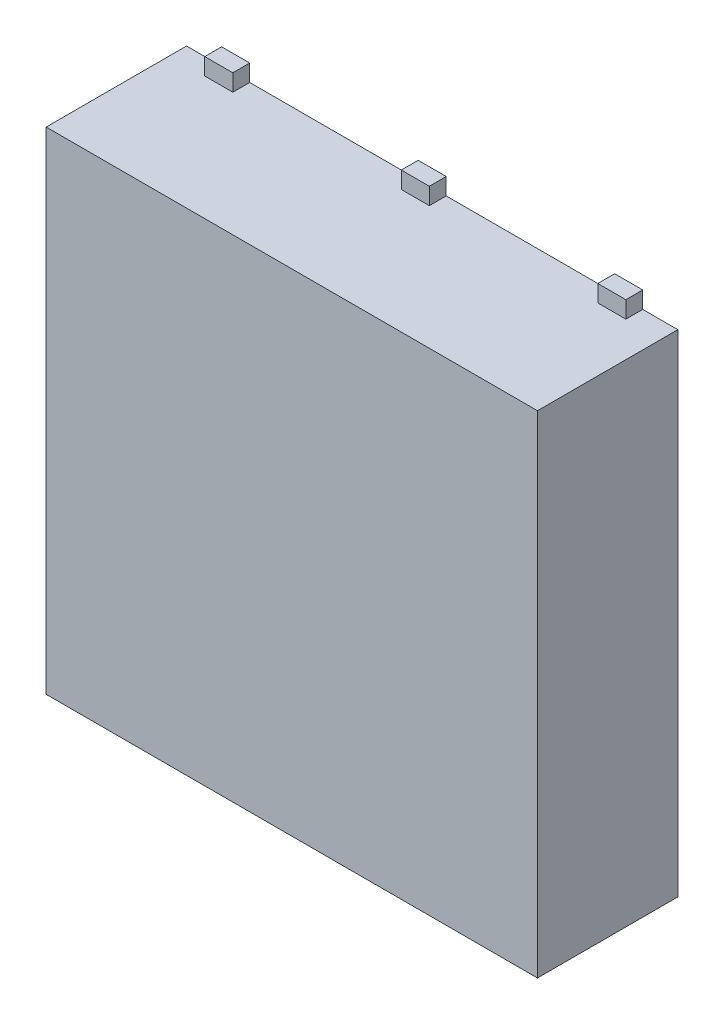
from build123d import *

# Parameters (mm, degrees)
ESQUISSE1_W                = 3.5
ESQUISSE1_H                = 3.5
BOSS_EXTRU_1_DEPTH         = 1
ESQUISSE2_W                = 0.2
ESQUISSE2_H                = 0.120247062
BOSS_EXTRU_2_DEPTH         = 0.12
R_P_TITION_LIN_AIRE1_COUNT = 2
R_P_TITION_LIN_AIRE1_PITCH = 1.4
R_P_TITION_LIN_AIRE2_COUNT = 2
R_P_TITION_LIN_AIRE2_PITCH = 1.4
SYM_TRIE1_COPY_1_SKETCH_W  = 0.2
SYM_TRIE1_COPY_1_SKETCH_H  = 0.120247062
SYM_TRIE1_COPY_1_DEPTH     = 0.12
SYM_TRIE1_COPY_2_SKETCH_W  = 0.2
SYM_TRIE1_COPY_2_SKETCH_H  = 0.120247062
SYM_TRIE1_COPY_2_DEPTH     = 0.12


with BuildPart() as part:
    # Esquisse1 → Boss.-Extru.1 (new body)
    with BuildSketch(Plane.XY):
        Rectangle(ESQUISSE1_W, ESQUISSE1_H)
    extrude(amount=BOSS_EXTRU_1_DEPTH)

    # Esquisse2 → Boss.-Extru.2 (add)
    with BuildSketch(Plane(origin=(0, 1.75, 0), x_dir=(1, 0, 0), z_dir=(0, 1, 0))):
        with Locations((0, -0.060123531)):
            Rectangle(ESQUISSE2_W, ESQUISSE2_H)
    boss_extru_2 = extrude(amount=BOSS_EXTRU_2_DEPTH)

    # R_p_tition lin_aire1: Boss.-Extru.2 ×2
    with Locations(*[(-i * R_P_TITION_LIN_AIRE1_PITCH, 0, 0) for i in range(1, R_P_TITION_LIN_AIRE1_COUNT)]):
        add(boss_extru_2)

    # R_p_tition lin_aire2: Boss.-Extru.2 ×2
    with Locations(*[(i * R_P_TITION_LIN_AIRE2_PITCH, 0, 0) for i in range(1, R_P_TITION_LIN_AIRE2_COUNT)]):
        add(boss_extru_2)

    # Sym_trie1: Boss.-Extru.2 across plane
    add(boss_extru_2.mirror(Plane.ZX))

    # Sym_trie1 copy 1 sketch → Sym_trie1 copy 1 (add)
    with BuildSketch(Plane(origin=(-1.4, -1.75, 0), x_dir=(1, 0, 0), z_dir=(0, -1, 0))):
        with Locations((0, 0.060123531)):
            Rectangle(SYM_TRIE1_COPY_1_SKETCH_W, SYM_TRIE1_COPY_1_SKETCH_H)
    extrude(amount=SYM_TRIE1_COPY_1_DEPTH)

    # Sym_trie1 copy 2 sketch → Sym_trie1 copy 2 (add)
    with BuildSketch(Plane(origin=(1.4, -1.75, 0), x_dir=(1, 0, 0), z_dir=(0, -1, 0))):
        with Locations((0, 0.060123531)):
            Rectangle(SYM_TRIE1_COPY_2_SKETCH_W, SYM_TRIE1_COPY_2_SKETCH_H)
    extrude(amount=SYM_TRIE1_COPY_2_DEPTH)


solid = part.part
